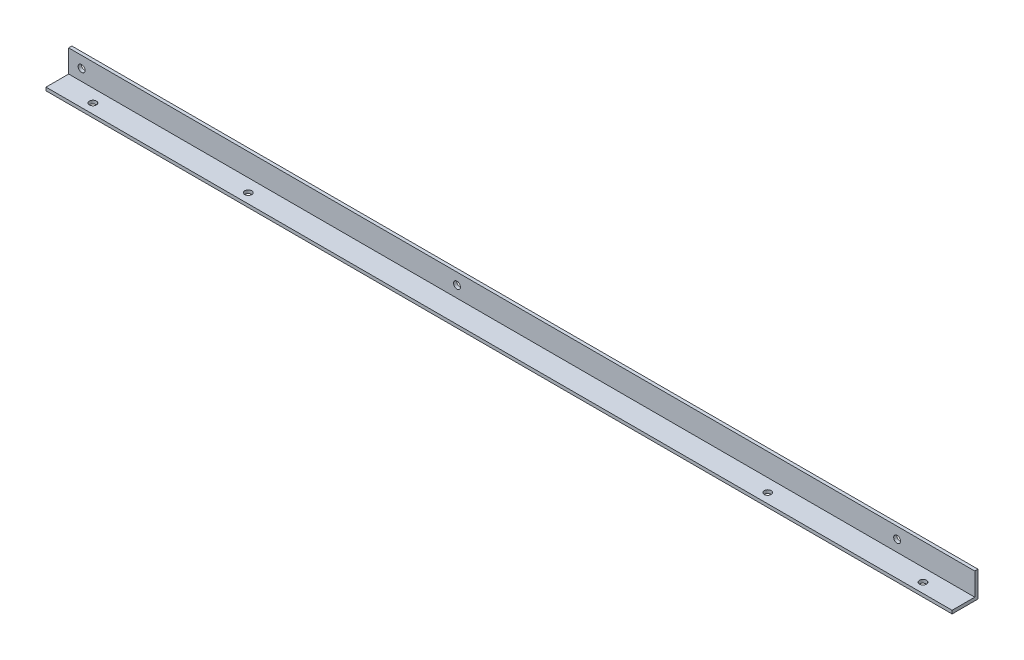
ISO-10303-21;
HEADER;
FILE_DESCRIPTION(('STEP AP214'),'2;1');
FILE_NAME('part.step','',(''),(''),'','','');
FILE_SCHEMA(('AUTOMOTIVE_DESIGN { 1 0 10303 214 1 1 1 1 }'));
ENDSEC;
DATA;
#1=APPLICATION_CONTEXT('core data for automotive mechanical design processes');
#2=APPLICATION_PROTOCOL_DEFINITION('international standard','automotive_design',2000,#1);
#3=PRODUCT_CONTEXT('',#1,'mechanical');
#4=PRODUCT('Part','Part','',(#3));
#5=PRODUCT_RELATED_PRODUCT_CATEGORY('part','',(#4));
#6=PRODUCT_DEFINITION_FORMATION('','',#4);
#7=PRODUCT_DEFINITION_CONTEXT('part definition',#1,'design');
#8=PRODUCT_DEFINITION('design','',#6,#7);
#9=PRODUCT_DEFINITION_SHAPE('','',#8);
#10=(LENGTH_UNIT() NAMED_UNIT(*) SI_UNIT(.MILLI.,.METRE.));
#11=(NAMED_UNIT(*) PLANE_ANGLE_UNIT() SI_UNIT($,.RADIAN.));
#12=(NAMED_UNIT(*) SI_UNIT($,.STERADIAN.) SOLID_ANGLE_UNIT());
#13=UNCERTAINTY_MEASURE_WITH_UNIT(LENGTH_MEASURE(1.E-05),#10,'distance_accuracy_value','');
#14=(GEOMETRIC_REPRESENTATION_CONTEXT(3) GLOBAL_UNCERTAINTY_ASSIGNED_CONTEXT((#13)) GLOBAL_UNIT_ASSIGNED_CONTEXT((#10,
#11,#12)) REPRESENTATION_CONTEXT('',''));
#15=CARTESIAN_POINT('',(0.,0.,0.));
#16=DIRECTION('',(0.,0.,1.));
#17=DIRECTION('',(1.,0.,0.));
#18=AXIS2_PLACEMENT_3D('',#15,#16,#17);
#19=CARTESIAN_POINT('',(444.5,3.175,-12.7));
#20=DIRECTION('',(-1.,0.,0.));
#21=DIRECTION('',(0.,0.,1.));
#22=AXIS2_PLACEMENT_3D('',#19,#20,#21);
#23=PLANE('',#22);
#24=DIRECTION('',(0.,0.,-1.));
#25=VECTOR('',#24,1.);
#26=CARTESIAN_POINT('',(444.5,0.,-12.7));
#27=LINE('',#26,#25);
#28=CARTESIAN_POINT('',(444.5,0.,12.7));
#29=VERTEX_POINT('',#28);
#30=CARTESIAN_POINT('',(444.5,0.,-12.7));
#31=VERTEX_POINT('',#30);
#32=EDGE_CURVE('E89',#29,#31,#27,.T.);
#33=ORIENTED_EDGE('',*,*,#32,.T.);
#34=DIRECTION('',(0.,-1.,0.));
#35=VECTOR('',#34,1.);
#36=CARTESIAN_POINT('',(444.5,3.175,-12.7));
#37=LINE('',#36,#35);
#38=CARTESIAN_POINT('',(444.5,25.4,-12.7));
#39=VERTEX_POINT('',#38);
#40=EDGE_CURVE('E11',#39,#31,#37,.T.);
#41=ORIENTED_EDGE('',*,*,#40,.F.);
#42=DIRECTION('',(0.,0.,-1.));
#43=VECTOR('',#42,1.);
#44=CARTESIAN_POINT('',(444.5,25.4,-9.525));
#45=LINE('',#44,#43);
#46=CARTESIAN_POINT('',(444.5,25.4,-9.525));
#47=VERTEX_POINT('',#46);
#48=EDGE_CURVE('E115',#47,#39,#45,.T.);
#49=ORIENTED_EDGE('',*,*,#48,.F.);
#50=DIRECTION('',(0.,-1.,0.));
#51=VECTOR('',#50,1.);
#52=CARTESIAN_POINT('',(444.5,25.4,-9.525));
#53=LINE('',#52,#51);
#54=CARTESIAN_POINT('',(444.5,3.175,-9.525));
#55=VERTEX_POINT('',#54);
#56=EDGE_CURVE('E98',#47,#55,#53,.T.);
#57=ORIENTED_EDGE('',*,*,#56,.T.);
#58=DIRECTION('',(0.,0.,-1.));
#59=VECTOR('',#58,1.);
#60=CARTESIAN_POINT('',(444.5,3.175,-12.7));
#61=LINE('',#60,#59);
#62=CARTESIAN_POINT('',(444.5,3.175,12.7));
#63=VERTEX_POINT('',#62);
#64=EDGE_CURVE('E83',#63,#55,#61,.T.);
#65=ORIENTED_EDGE('',*,*,#64,.F.);
#66=DIRECTION('',(0.,-1.,0.));
#67=VECTOR('',#66,1.);
#68=CARTESIAN_POINT('',(444.5,3.175,12.7));
#69=LINE('',#68,#67);
#70=EDGE_CURVE('E76',#63,#29,#69,.T.);
#71=ORIENTED_EDGE('',*,*,#70,.T.);
#72=EDGE_LOOP('',(#33,#41,#49,#57,#65,#71));
#73=FACE_BOUND('',#72,.T.);
#74=ADVANCED_FACE('F32',(#73),#23,.F.);
#75=CARTESIAN_POINT('',(-444.5,3.175,-12.7));
#76=DIRECTION('',(0.,0.,1.));
#77=DIRECTION('',(1.,0.,0.));
#78=AXIS2_PLACEMENT_3D('',#75,#76,#77);
#79=PLANE('',#78);
#80=CARTESIAN_POINT('',(-431.8,14.2875,-12.7));
#81=DIRECTION('',(0.,0.,1.));
#82=DIRECTION('',(1.,0.,0.));
#83=AXIS2_PLACEMENT_3D('',#80,#81,#82);
#84=CIRCLE('',#83,3.37819999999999);
#85=CARTESIAN_POINT('',(-428.4218,14.2875,-12.7));
#86=VERTEX_POINT('',#85);
#87=EDGE_CURVE('E171',#86,#86,#84,.T.);
#88=ORIENTED_EDGE('',*,*,#87,.T.);
#89=EDGE_LOOP('',(#88));
#90=FACE_BOUND('',#89,.T.);
#91=CARTESIAN_POINT('',(-63.5,14.2875,-12.7));
#92=DIRECTION('',(0.,0.,1.));
#93=DIRECTION('',(1.,0.,0.));
#94=AXIS2_PLACEMENT_3D('',#91,#92,#93);
#95=CIRCLE('',#94,3.37819999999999);
#96=CARTESIAN_POINT('',(-60.1218,14.2875,-12.7));
#97=VERTEX_POINT('',#96);
#98=EDGE_CURVE('E165',#97,#97,#95,.T.);
#99=ORIENTED_EDGE('',*,*,#98,.T.);
#100=EDGE_LOOP('',(#99));
#101=FACE_BOUND('',#100,.T.);
#102=CARTESIAN_POINT('',(368.3,14.2875,-12.7));
#103=DIRECTION('',(0.,0.,1.));
#104=DIRECTION('',(1.,0.,0.));
#105=AXIS2_PLACEMENT_3D('',#102,#103,#104);
#106=CIRCLE('',#105,3.37819999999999);
#107=CARTESIAN_POINT('',(371.6782,14.2875,-12.7));
#108=VERTEX_POINT('',#107);
#109=EDGE_CURVE('E159',#108,#108,#106,.T.);
#110=ORIENTED_EDGE('',*,*,#109,.T.);
#111=EDGE_LOOP('',(#110));
#112=FACE_BOUND('',#111,.T.);
#113=DIRECTION('',(-1.,0.,0.));
#114=VECTOR('',#113,1.);
#115=CARTESIAN_POINT('',(-444.5,0.,-12.7));
#116=LINE('',#115,#114);
#117=CARTESIAN_POINT('',(-444.5,0.,-12.7));
#118=VERTEX_POINT('',#117);
#119=EDGE_CURVE('E93',#31,#118,#116,.T.);
#120=ORIENTED_EDGE('',*,*,#119,.T.);
#121=DIRECTION('',(0.,-1.,0.));
#122=VECTOR('',#121,1.);
#123=CARTESIAN_POINT('',(-444.5,3.175,-12.7));
#124=LINE('',#123,#122);
#125=CARTESIAN_POINT('',(-444.5,25.4,-12.7));
#126=VERTEX_POINT('',#125);
#127=EDGE_CURVE('E40',#126,#118,#124,.T.);
#128=ORIENTED_EDGE('',*,*,#127,.F.);
#129=DIRECTION('',(-1.,0.,0.));
#130=VECTOR('',#129,1.);
#131=CARTESIAN_POINT('',(444.5,25.4,-12.7));
#132=LINE('',#131,#130);
#133=EDGE_CURVE('E118',#39,#126,#132,.T.);
#134=ORIENTED_EDGE('',*,*,#133,.F.);
#135=ORIENTED_EDGE('',*,*,#40,.T.);
#136=EDGE_LOOP('',(#120,#128,#134,#135));
#137=FACE_BOUND('',#136,.T.);
#138=ADVANCED_FACE('F180',(#90,#101,#112,#137),#79,.F.);
#139=CARTESIAN_POINT('',(-444.5,3.175,-12.7));
#140=DIRECTION('',(1.,0.,0.));
#141=DIRECTION('',(0.,0.,-1.));
#142=AXIS2_PLACEMENT_3D('',#139,#140,#141);
#143=PLANE('',#142);
#144=DIRECTION('',(0.,0.,1.));
#145=VECTOR('',#144,1.);
#146=CARTESIAN_POINT('',(-444.5,0.,-12.7));
#147=LINE('',#146,#145);
#148=CARTESIAN_POINT('',(-444.5,0.,12.7));
#149=VERTEX_POINT('',#148);
#150=EDGE_CURVE('E84',#118,#149,#147,.T.);
#151=ORIENTED_EDGE('',*,*,#150,.T.);
#152=DIRECTION('',(0.,-1.,0.));
#153=VECTOR('',#152,1.);
#154=CARTESIAN_POINT('',(-444.5,3.175,12.7));
#155=LINE('',#154,#153);
#156=CARTESIAN_POINT('',(-444.5,3.175,12.7));
#157=VERTEX_POINT('',#156);
#158=EDGE_CURVE('E79',#157,#149,#155,.T.);
#159=ORIENTED_EDGE('',*,*,#158,.F.);
#160=DIRECTION('',(0.,0.,1.));
#161=VECTOR('',#160,1.);
#162=CARTESIAN_POINT('',(-444.5,3.175,-12.7));
#163=LINE('',#162,#161);
#164=CARTESIAN_POINT('',(-444.5,3.175,-9.525));
#165=VERTEX_POINT('',#164);
#166=EDGE_CURVE('E108',#165,#157,#163,.T.);
#167=ORIENTED_EDGE('',*,*,#166,.F.);
#168=DIRECTION('',(0.,-1.,0.));
#169=VECTOR('',#168,1.);
#170=CARTESIAN_POINT('',(-444.5,25.4,-9.525));
#171=LINE('',#170,#169);
#172=CARTESIAN_POINT('',(-444.5,25.4,-9.525));
#173=VERTEX_POINT('',#172);
#174=EDGE_CURVE('E94',#173,#165,#171,.T.);
#175=ORIENTED_EDGE('',*,*,#174,.F.);
#176=DIRECTION('',(0.,0.,1.));
#177=VECTOR('',#176,1.);
#178=CARTESIAN_POINT('',(-444.5,25.4,-12.7));
#179=LINE('',#178,#177);
#180=EDGE_CURVE('E131',#126,#173,#179,.T.);
#181=ORIENTED_EDGE('',*,*,#180,.F.);
#182=ORIENTED_EDGE('',*,*,#127,.T.);
#183=EDGE_LOOP('',(#151,#159,#167,#175,#181,#182));
#184=FACE_BOUND('',#183,.T.);
#185=ADVANCED_FACE('F209',(#184),#143,.F.);
#186=CARTESIAN_POINT('',(-444.5,3.175,12.7));
#187=DIRECTION('',(0.,0.,-1.));
#188=DIRECTION('',(-1.,0.,0.));
#189=AXIS2_PLACEMENT_3D('',#186,#187,#188);
#190=PLANE('',#189);
#191=DIRECTION('',(1.,0.,0.));
#192=VECTOR('',#191,1.);
#193=CARTESIAN_POINT('',(-444.5,0.,12.7));
#194=LINE('',#193,#192);
#195=EDGE_CURVE('E73',#149,#29,#194,.T.);
#196=ORIENTED_EDGE('',*,*,#195,.T.);
#197=ORIENTED_EDGE('',*,*,#70,.F.);
#198=DIRECTION('',(1.,0.,0.));
#199=VECTOR('',#198,1.);
#200=CARTESIAN_POINT('',(-444.5,3.175,12.7));
#201=LINE('',#200,#199);
#202=EDGE_CURVE('E54',#157,#63,#201,.T.);
#203=ORIENTED_EDGE('',*,*,#202,.F.);
#204=ORIENTED_EDGE('',*,*,#158,.T.);
#205=EDGE_LOOP('',(#196,#197,#203,#204));
#206=FACE_BOUND('',#205,.T.);
#207=ADVANCED_FACE('F75',(#206),#190,.F.);
#208=CARTESIAN_POINT('',(444.5,3.175,12.7));
#209=DIRECTION('',(0.,1.,0.));
#210=DIRECTION('',(0.,0.,1.));
#211=AXIS2_PLACEMENT_3D('',#208,#209,#210);
#212=PLANE('',#211);
#213=CARTESIAN_POINT('',(254.,3.175,3.175));
#214=DIRECTION('',(0.,1.,0.));
#215=DIRECTION('',(0.,0.,1.));
#216=AXIS2_PLACEMENT_3D('',#213,#214,#215);
#217=CIRCLE('',#216,3.37819999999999);
#218=CARTESIAN_POINT('',(254.,3.175,6.55319999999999));
#219=VERTEX_POINT('',#218);
#220=EDGE_CURVE('E156',#219,#219,#217,.T.);
#221=ORIENTED_EDGE('',*,*,#220,.F.);
#222=EDGE_LOOP('',(#221));
#223=FACE_BOUND('',#222,.T.);
#224=CARTESIAN_POINT('',(406.4,3.175,3.175));
#225=DIRECTION('',(0.,1.,0.));
#226=DIRECTION('',(0.,0.,1.));
#227=AXIS2_PLACEMENT_3D('',#224,#225,#226);
#228=CIRCLE('',#227,3.37819999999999);
#229=CARTESIAN_POINT('',(406.4,3.175,6.55319999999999));
#230=VERTEX_POINT('',#229);
#231=EDGE_CURVE('E150',#230,#230,#228,.T.);
#232=ORIENTED_EDGE('',*,*,#231,.F.);
#233=EDGE_LOOP('',(#232));
#234=FACE_BOUND('',#233,.T.);
#235=CARTESIAN_POINT('',(-255.5875,3.175,3.175));
#236=DIRECTION('',(0.,1.,0.));
#237=DIRECTION('',(0.,0.,1.));
#238=AXIS2_PLACEMENT_3D('',#235,#236,#237);
#239=CIRCLE('',#238,3.37819999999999);
#240=CARTESIAN_POINT('',(-255.5875,3.175,6.55319999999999));
#241=VERTEX_POINT('',#240);
#242=EDGE_CURVE('E144',#241,#241,#239,.T.);
#243=ORIENTED_EDGE('',*,*,#242,.F.);
#244=EDGE_LOOP('',(#243));
#245=FACE_BOUND('',#244,.T.);
#246=CARTESIAN_POINT('',(-407.9875,3.175,3.175));
#247=DIRECTION('',(0.,1.,0.));
#248=DIRECTION('',(0.,0.,1.));
#249=AXIS2_PLACEMENT_3D('',#246,#247,#248);
#250=CIRCLE('',#249,3.37819999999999);
#251=CARTESIAN_POINT('',(-407.9875,3.175,6.55319999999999));
#252=VERTEX_POINT('',#251);
#253=EDGE_CURVE('E138',#252,#252,#250,.T.);
#254=ORIENTED_EDGE('',*,*,#253,.F.);
#255=EDGE_LOOP('',(#254));
#256=FACE_BOUND('',#255,.T.);
#257=DIRECTION('',(1.,0.,0.));
#258=VECTOR('',#257,1.);
#259=CARTESIAN_POINT('',(-444.5,3.175,-9.525));
#260=LINE('',#259,#258);
#261=EDGE_CURVE('E48',#165,#55,#260,.T.);
#262=ORIENTED_EDGE('',*,*,#261,.F.);
#263=ORIENTED_EDGE('',*,*,#166,.T.);
#264=ORIENTED_EDGE('',*,*,#202,.T.);
#265=ORIENTED_EDGE('',*,*,#64,.T.);
#266=EDGE_LOOP('',(#262,#263,#264,#265));
#267=FACE_BOUND('',#266,.T.);
#268=ADVANCED_FACE('F210',(#223,#234,#245,#256,#267),#212,.T.);
#269=CARTESIAN_POINT('',(444.5,0.,12.7));
#270=DIRECTION('',(0.,1.,0.));
#271=DIRECTION('',(0.,0.,1.));
#272=AXIS2_PLACEMENT_3D('',#269,#270,#271);
#273=PLANE('',#272);
#274=CARTESIAN_POINT('',(254.,0.,3.175));
#275=DIRECTION('',(0.,1.,0.));
#276=DIRECTION('',(0.,0.,1.));
#277=AXIS2_PLACEMENT_3D('',#274,#275,#276);
#278=CIRCLE('',#277,3.37819999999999);
#279=CARTESIAN_POINT('',(254.,0.,6.55319999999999));
#280=VERTEX_POINT('',#279);
#281=EDGE_CURVE('E153',#280,#280,#278,.T.);
#282=ORIENTED_EDGE('',*,*,#281,.T.);
#283=EDGE_LOOP('',(#282));
#284=FACE_BOUND('',#283,.T.);
#285=CARTESIAN_POINT('',(406.4,0.,3.175));
#286=DIRECTION('',(0.,1.,0.));
#287=DIRECTION('',(0.,0.,1.));
#288=AXIS2_PLACEMENT_3D('',#285,#286,#287);
#289=CIRCLE('',#288,3.37819999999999);
#290=CARTESIAN_POINT('',(406.4,0.,6.55319999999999));
#291=VERTEX_POINT('',#290);
#292=EDGE_CURVE('E147',#291,#291,#289,.T.);
#293=ORIENTED_EDGE('',*,*,#292,.T.);
#294=EDGE_LOOP('',(#293));
#295=FACE_BOUND('',#294,.T.);
#296=CARTESIAN_POINT('',(-255.5875,0.,3.175));
#297=DIRECTION('',(0.,1.,0.));
#298=DIRECTION('',(0.,0.,1.));
#299=AXIS2_PLACEMENT_3D('',#296,#297,#298);
#300=CIRCLE('',#299,3.37819999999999);
#301=CARTESIAN_POINT('',(-255.5875,0.,6.55319999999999));
#302=VERTEX_POINT('',#301);
#303=EDGE_CURVE('E141',#302,#302,#300,.T.);
#304=ORIENTED_EDGE('',*,*,#303,.T.);
#305=EDGE_LOOP('',(#304));
#306=FACE_BOUND('',#305,.T.);
#307=CARTESIAN_POINT('',(-407.9875,0.,3.175));
#308=DIRECTION('',(0.,1.,0.));
#309=DIRECTION('',(0.,0.,1.));
#310=AXIS2_PLACEMENT_3D('',#307,#308,#309);
#311=CIRCLE('',#310,3.37819999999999);
#312=CARTESIAN_POINT('',(-407.9875,0.,6.55319999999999));
#313=VERTEX_POINT('',#312);
#314=EDGE_CURVE('E119',#313,#313,#311,.T.);
#315=ORIENTED_EDGE('',*,*,#314,.T.);
#316=EDGE_LOOP('',(#315));
#317=FACE_BOUND('',#316,.T.);
#318=ORIENTED_EDGE('',*,*,#32,.F.);
#319=ORIENTED_EDGE('',*,*,#195,.F.);
#320=ORIENTED_EDGE('',*,*,#150,.F.);
#321=ORIENTED_EDGE('',*,*,#119,.F.);
#322=EDGE_LOOP('',(#318,#319,#320,#321));
#323=FACE_BOUND('',#322,.T.);
#324=ADVANCED_FACE('F92',(#284,#295,#306,#317,#323),#273,.F.);
#325=CARTESIAN_POINT('',(-444.5,25.4,-9.525));
#326=DIRECTION('',(0.,0.,-1.));
#327=DIRECTION('',(-1.,0.,0.));
#328=AXIS2_PLACEMENT_3D('',#325,#326,#327);
#329=PLANE('',#328);
#330=CARTESIAN_POINT('',(-431.8,14.2875,-9.525));
#331=DIRECTION('',(0.,0.,1.));
#332=DIRECTION('',(1.,0.,0.));
#333=AXIS2_PLACEMENT_3D('',#330,#331,#332);
#334=CIRCLE('',#333,3.37819999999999);
#335=CARTESIAN_POINT('',(-428.4218,14.2875,-9.525));
#336=VERTEX_POINT('',#335);
#337=EDGE_CURVE('E174',#336,#336,#334,.T.);
#338=ORIENTED_EDGE('',*,*,#337,.F.);
#339=EDGE_LOOP('',(#338));
#340=FACE_BOUND('',#339,.T.);
#341=CARTESIAN_POINT('',(-63.5,14.2875,-9.525));
#342=DIRECTION('',(0.,0.,1.));
#343=DIRECTION('',(1.,0.,0.));
#344=AXIS2_PLACEMENT_3D('',#341,#342,#343);
#345=CIRCLE('',#344,3.37819999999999);
#346=CARTESIAN_POINT('',(-60.1218,14.2875,-9.525));
#347=VERTEX_POINT('',#346);
#348=EDGE_CURVE('E168',#347,#347,#345,.T.);
#349=ORIENTED_EDGE('',*,*,#348,.F.);
#350=EDGE_LOOP('',(#349));
#351=FACE_BOUND('',#350,.T.);
#352=CARTESIAN_POINT('',(368.3,14.2875,-9.525));
#353=DIRECTION('',(0.,0.,1.));
#354=DIRECTION('',(1.,0.,0.));
#355=AXIS2_PLACEMENT_3D('',#352,#353,#354);
#356=CIRCLE('',#355,3.37819999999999);
#357=CARTESIAN_POINT('',(371.6782,14.2875,-9.525));
#358=VERTEX_POINT('',#357);
#359=EDGE_CURVE('E162',#358,#358,#356,.T.);
#360=ORIENTED_EDGE('',*,*,#359,.F.);
#361=EDGE_LOOP('',(#360));
#362=FACE_BOUND('',#361,.T.);
#363=ORIENTED_EDGE('',*,*,#261,.T.);
#364=ORIENTED_EDGE('',*,*,#56,.F.);
#365=DIRECTION('',(1.,0.,0.));
#366=VECTOR('',#365,1.);
#367=CARTESIAN_POINT('',(-444.5,25.4,-9.525));
#368=LINE('',#367,#366);
#369=EDGE_CURVE('E126',#173,#47,#368,.T.);
#370=ORIENTED_EDGE('',*,*,#369,.F.);
#371=ORIENTED_EDGE('',*,*,#174,.T.);
#372=EDGE_LOOP('',(#363,#364,#370,#371));
#373=FACE_BOUND('',#372,.T.);
#374=ADVANCED_FACE('F190',(#340,#351,#362,#373),#329,.F.);
#375=CARTESIAN_POINT('',(-444.5,25.4,-12.7));
#376=DIRECTION('',(0.,1.,0.));
#377=DIRECTION('',(0.,0.,1.));
#378=AXIS2_PLACEMENT_3D('',#375,#376,#377);
#379=PLANE('',#378);
#380=ORIENTED_EDGE('',*,*,#133,.T.);
#381=ORIENTED_EDGE('',*,*,#180,.T.);
#382=ORIENTED_EDGE('',*,*,#369,.T.);
#383=ORIENTED_EDGE('',*,*,#48,.T.);
#384=EDGE_LOOP('',(#380,#381,#382,#383));
#385=FACE_BOUND('',#384,.T.);
#386=ADVANCED_FACE('F193',(#385),#379,.T.);
#387=CARTESIAN_POINT('',(-407.9875,0.,3.175));
#388=DIRECTION('',(0.,1.,0.));
#389=DIRECTION('',(0.,0.,1.));
#390=AXIS2_PLACEMENT_3D('',#387,#388,#389);
#391=CYLINDRICAL_SURFACE('',#390,3.37819999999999);
#392=ORIENTED_EDGE('',*,*,#314,.F.);
#393=EDGE_LOOP('',(#392));
#394=FACE_BOUND('',#393,.T.);
#395=ORIENTED_EDGE('',*,*,#253,.T.);
#396=EDGE_LOOP('',(#395));
#397=FACE_BOUND('',#396,.T.);
#398=ADVANCED_FACE('F278',(#394,#397),#391,.F.);
#399=CARTESIAN_POINT('',(-255.5875,0.,3.175));
#400=DIRECTION('',(0.,1.,0.));
#401=DIRECTION('',(0.,0.,1.));
#402=AXIS2_PLACEMENT_3D('',#399,#400,#401);
#403=CYLINDRICAL_SURFACE('',#402,3.37819999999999);
#404=ORIENTED_EDGE('',*,*,#303,.F.);
#405=EDGE_LOOP('',(#404));
#406=FACE_BOUND('',#405,.T.);
#407=ORIENTED_EDGE('',*,*,#242,.T.);
#408=EDGE_LOOP('',(#407));
#409=FACE_BOUND('',#408,.T.);
#410=ADVANCED_FACE('F286',(#406,#409),#403,.F.);
#411=CARTESIAN_POINT('',(406.4,0.,3.175));
#412=DIRECTION('',(0.,1.,0.));
#413=DIRECTION('',(0.,0.,1.));
#414=AXIS2_PLACEMENT_3D('',#411,#412,#413);
#415=CYLINDRICAL_SURFACE('',#414,3.37819999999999);
#416=ORIENTED_EDGE('',*,*,#292,.F.);
#417=EDGE_LOOP('',(#416));
#418=FACE_BOUND('',#417,.T.);
#419=ORIENTED_EDGE('',*,*,#231,.T.);
#420=EDGE_LOOP('',(#419));
#421=FACE_BOUND('',#420,.T.);
#422=ADVANCED_FACE('F295',(#418,#421),#415,.F.);
#423=CARTESIAN_POINT('',(254.,0.,3.175));
#424=DIRECTION('',(0.,1.,0.));
#425=DIRECTION('',(0.,0.,1.));
#426=AXIS2_PLACEMENT_3D('',#423,#424,#425);
#427=CYLINDRICAL_SURFACE('',#426,3.37819999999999);
#428=ORIENTED_EDGE('',*,*,#281,.F.);
#429=EDGE_LOOP('',(#428));
#430=FACE_BOUND('',#429,.T.);
#431=ORIENTED_EDGE('',*,*,#220,.T.);
#432=EDGE_LOOP('',(#431));
#433=FACE_BOUND('',#432,.T.);
#434=ADVANCED_FACE('F304',(#430,#433),#427,.F.);
#435=CARTESIAN_POINT('',(368.3,14.2875,-12.7));
#436=DIRECTION('',(0.,0.,1.));
#437=DIRECTION('',(1.,0.,0.));
#438=AXIS2_PLACEMENT_3D('',#435,#436,#437);
#439=CYLINDRICAL_SURFACE('',#438,3.37819999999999);
#440=ORIENTED_EDGE('',*,*,#109,.F.);
#441=EDGE_LOOP('',(#440));
#442=FACE_BOUND('',#441,.T.);
#443=ORIENTED_EDGE('',*,*,#359,.T.);
#444=EDGE_LOOP('',(#443));
#445=FACE_BOUND('',#444,.T.);
#446=ADVANCED_FACE('F312',(#442,#445),#439,.F.);
#447=CARTESIAN_POINT('',(-63.5,14.2875,-12.7));
#448=DIRECTION('',(0.,0.,1.));
#449=DIRECTION('',(1.,0.,0.));
#450=AXIS2_PLACEMENT_3D('',#447,#448,#449);
#451=CYLINDRICAL_SURFACE('',#450,3.37819999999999);
#452=ORIENTED_EDGE('',*,*,#98,.F.);
#453=EDGE_LOOP('',(#452));
#454=FACE_BOUND('',#453,.T.);
#455=ORIENTED_EDGE('',*,*,#348,.T.);
#456=EDGE_LOOP('',(#455));
#457=FACE_BOUND('',#456,.T.);
#458=ADVANCED_FACE('F186',(#454,#457),#451,.F.);
#459=CARTESIAN_POINT('',(-431.8,14.2875,-12.7));
#460=DIRECTION('',(0.,0.,1.));
#461=DIRECTION('',(1.,0.,0.));
#462=AXIS2_PLACEMENT_3D('',#459,#460,#461);
#463=CYLINDRICAL_SURFACE('',#462,3.37819999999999);
#464=ORIENTED_EDGE('',*,*,#87,.F.);
#465=EDGE_LOOP('',(#464));
#466=FACE_BOUND('',#465,.T.);
#467=ORIENTED_EDGE('',*,*,#337,.T.);
#468=EDGE_LOOP('',(#467));
#469=FACE_BOUND('',#468,.T.);
#470=ADVANCED_FACE('F183',(#466,#469),#463,.F.);
#471=CLOSED_SHELL('',(#74,#138,#185,#207,#268,#324,#374,#386,#398,#410,#422,#434,#446,#458,#470));
#472=MANIFOLD_SOLID_BREP('B2',#471);
#473=ADVANCED_BREP_SHAPE_REPRESENTATION('',(#18,#472),#14);
#474=SHAPE_DEFINITION_REPRESENTATION(#9,#473);
ENDSEC;
END-ISO-10303-21;
